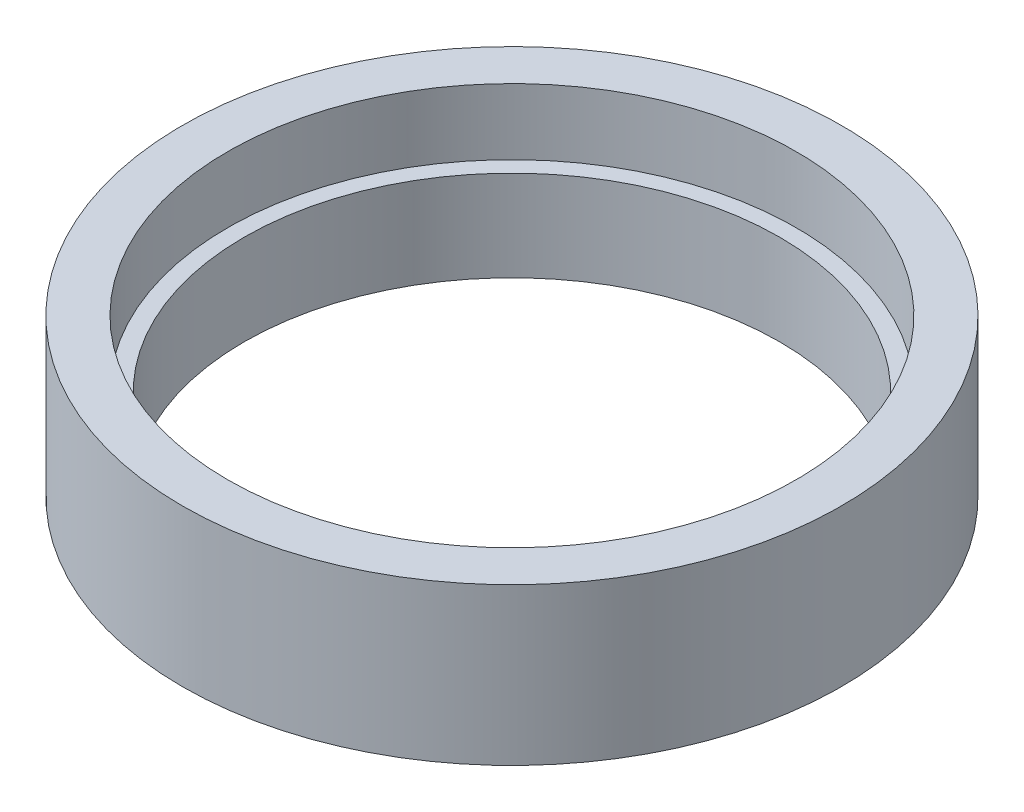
from build123d import *

# Parameters (mm, degrees)
CROQUIS1_R              = 40
SALIENTE_EXTRUIR1_DEPTH = 19
CROQUIS2_R              = 34.5
CORTAR_EXTRUIR1_DEPTH   = 8
CROQUIS3_R              = 32.5
CORTAR_EXTRUIR2_DEPTH   = 48


with BuildPart() as part:
    # Croquis1 → Saliente-Extruir1 (new body)
    with BuildSketch(Plane(origin=(0, 0, 0), x_dir=(1, 0, 0), z_dir=(0, 1, 0))):
        with Locations(Location((0, 0, 0), (0, 0, 270))):
            Circle(CROQUIS1_R)
    extrude(amount=SALIENTE_EXTRUIR1_DEPTH)

    # Croquis2 → Cortar-Extruir1 (cut)
    with BuildSketch(Plane(origin=(0, 19, 0), x_dir=(1, 0, 0), z_dir=(0, 1, 0))):
        with Locations(Location((0, 0, 0), (0, 0, 270))):
            Circle(CROQUIS2_R)
    extrude(amount=-CORTAR_EXTRUIR1_DEPTH, mode=Mode.SUBTRACT)

    # Croquis3 → Cortar-Extruir2 (cut)
    with BuildSketch(Plane(origin=(0, 11, 0), x_dir=(1, 0, 0), z_dir=(0, 1, 0))):
        with Locations(Location((0, 0, 0), (0, 0, 270))):
            Circle(CROQUIS3_R)
    extrude(amount=-CORTAR_EXTRUIR2_DEPTH, mode=Mode.SUBTRACT)


solid = part.part
